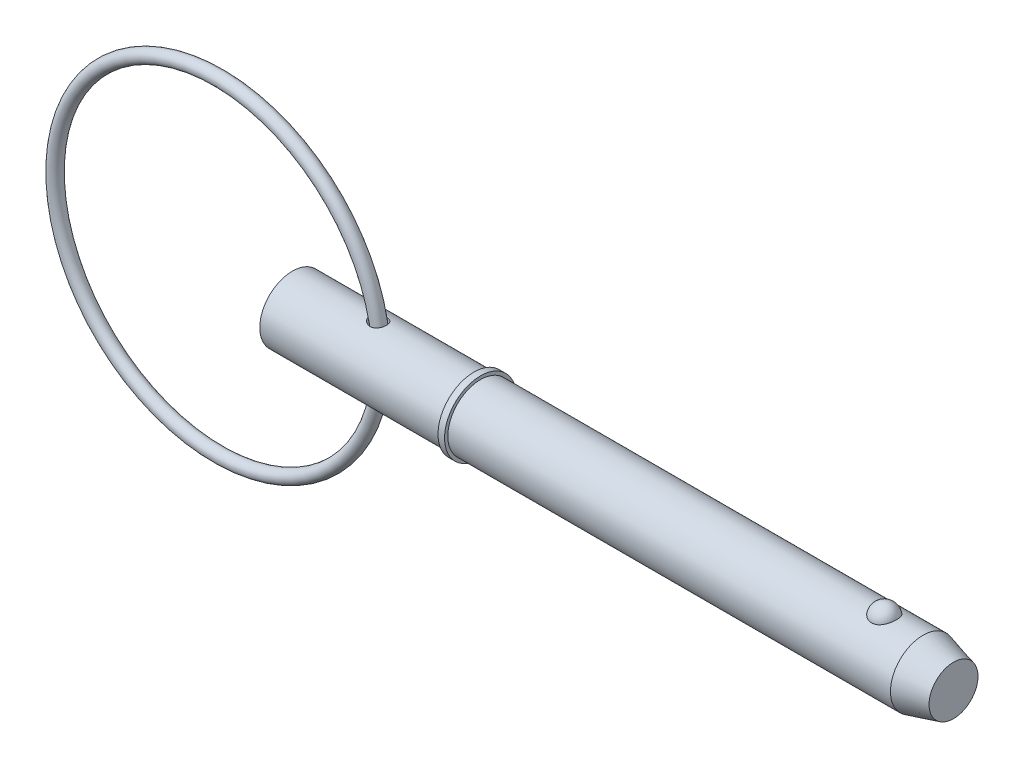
ISO-10303-21;
HEADER;
FILE_DESCRIPTION(('STEP AP214'),'2;1');
FILE_NAME('part.step','',(''),(''),'','','');
FILE_SCHEMA(('AUTOMOTIVE_DESIGN { 1 0 10303 214 1 1 1 1 }'));
ENDSEC;
DATA;
#1=APPLICATION_CONTEXT('core data for automotive mechanical design processes');
#2=APPLICATION_PROTOCOL_DEFINITION('international standard','automotive_design',2000,#1);
#3=PRODUCT_CONTEXT('',#1,'mechanical');
#4=PRODUCT('Part','Part','',(#3));
#5=PRODUCT_RELATED_PRODUCT_CATEGORY('part','',(#4));
#6=PRODUCT_DEFINITION_FORMATION('','',#4);
#7=PRODUCT_DEFINITION_CONTEXT('part definition',#1,'design');
#8=PRODUCT_DEFINITION('design','',#6,#7);
#9=PRODUCT_DEFINITION_SHAPE('','',#8);
#10=(LENGTH_UNIT() NAMED_UNIT(*) SI_UNIT(.MILLI.,.METRE.));
#11=(NAMED_UNIT(*) PLANE_ANGLE_UNIT() SI_UNIT($,.RADIAN.));
#12=(NAMED_UNIT(*) SI_UNIT($,.STERADIAN.) SOLID_ANGLE_UNIT());
#13=UNCERTAINTY_MEASURE_WITH_UNIT(LENGTH_MEASURE(1.E-05),#10,'distance_accuracy_value','');
#14=(GEOMETRIC_REPRESENTATION_CONTEXT(3) GLOBAL_UNCERTAINTY_ASSIGNED_CONTEXT((#13)) GLOBAL_UNIT_ASSIGNED_CONTEXT((#10,
#11,#12)) REPRESENTATION_CONTEXT('',''));
#15=CARTESIAN_POINT('',(0.,0.,0.));
#16=DIRECTION('',(0.,0.,1.));
#17=DIRECTION('',(1.,0.,0.));
#18=AXIS2_PLACEMENT_3D('',#15,#16,#17);
#19=CARTESIAN_POINT('',(-7.21857545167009,0.,0.));
#20=DIRECTION('',(0.,0.,1.));
#21=DIRECTION('',(1.,0.,0.));
#22=AXIS2_PLACEMENT_3D('',#19,#20,#21);
#23=TOROIDAL_SURFACE('',#22,15.875,0.634999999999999);
#24=CARTESIAN_POINT('',(9.29142454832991,0.,0.));
#25=VERTEX_POINT('',#24);
#26=VERTEX_LOOP('',#25);
#27=FACE_BOUND('',#26,.T.);
#28=ADVANCED_FACE('P0_F12',(#27),#23,.T.);
#29=CLOSED_SHELL('',(#28));
#30=MANIFOLD_SOLID_BREP('P0_B1',#29);
#31=CARTESIAN_POINT('',(0.,0.,0.));
#32=DIRECTION('',(1.,0.,0.));
#33=DIRECTION('',(0.,0.,-1.));
#34=AXIS2_PLACEMENT_3D('',#31,#32,#33);
#35=CYLINDRICAL_SURFACE('',#34,3.175);
#36=CARTESIAN_POINT('',(7.68750254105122,3.14043953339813,-0.467187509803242));
#37=CARTESIAN_POINT('',(7.71663570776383,3.13485007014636,-0.504758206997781));
#38=CARTESIAN_POINT('',(7.74907441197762,3.12895198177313,-0.539757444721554));
#39=CARTESIAN_POINT('',(7.81944011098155,3.11722901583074,-0.603799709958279));
#40=CARTESIAN_POINT('',(7.85737550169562,3.11140426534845,-0.632833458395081));
#41=CARTESIAN_POINT('',(7.93756775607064,3.10051072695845,-0.684213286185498));
#42=CARTESIAN_POINT('',(7.97981919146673,3.09544100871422,-0.706567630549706));
#43=CARTESIAN_POINT('',(8.06754397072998,3.08665483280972,-0.744015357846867));
#44=CARTESIAN_POINT('',(8.11301598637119,3.08293782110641,-0.759111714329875));
#45=CARTESIAN_POINT('',(8.20614871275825,3.07732974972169,-0.781538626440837));
#46=CARTESIAN_POINT('',(8.25381727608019,3.07544587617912,-0.788838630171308));
#47=CARTESIAN_POINT('',(8.34973955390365,3.07382984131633,-0.795114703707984));
#48=CARTESIAN_POINT('',(8.39799308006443,3.07409700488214,-0.794093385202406));
#49=CARTESIAN_POINT('',(8.4909727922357,3.07673252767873,-0.783815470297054));
#50=CARTESIAN_POINT('',(8.53575064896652,3.07898913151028,-0.774996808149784));
#51=CARTESIAN_POINT('',(8.62301664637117,3.08521060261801,-0.749844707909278));
#52=CARTESIAN_POINT('',(8.66550527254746,3.08917510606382,-0.733512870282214));
#53=CARTESIAN_POINT('',(8.74528857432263,3.09816330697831,-0.694543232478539));
#54=CARTESIAN_POINT('',(8.78272109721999,3.10313973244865,-0.672175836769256));
#55=CARTESIAN_POINT('',(8.85323831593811,3.11368155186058,-0.621513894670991));
#56=CARTESIAN_POINT('',(8.88632295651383,3.1192469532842,-0.59321927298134));
#57=CARTESIAN_POINT('',(8.94738786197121,3.13037258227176,-0.531394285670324));
#58=CARTESIAN_POINT('',(8.97535151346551,3.13593273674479,-0.497847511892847));
#59=CARTESIAN_POINT('',(9.02535984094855,3.14642822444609,-0.426512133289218));
#60=CARTESIAN_POINT('',(9.04740412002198,3.1513635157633,-0.388723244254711));
#61=CARTESIAN_POINT('',(9.08531615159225,3.16014674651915,-0.309373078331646));
#62=CARTESIAN_POINT('',(9.10109111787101,3.16397813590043,-0.267765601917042));
#63=CARTESIAN_POINT('',(9.12562372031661,3.17004373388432,-0.182419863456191));
#64=CARTESIAN_POINT('',(9.13438129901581,3.17227792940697,-0.138681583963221));
#65=CARTESIAN_POINT('',(9.14467797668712,3.17491257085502,-0.0501907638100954));
#66=CARTESIAN_POINT('',(9.14619790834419,3.17530814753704,-0.00543584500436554));
#67=CARTESIAN_POINT('',(9.14192925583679,3.17420952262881,0.0837005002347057));
#68=CARTESIAN_POINT('',(9.13614065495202,3.17271531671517,0.128081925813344));
#69=CARTESIAN_POINT('',(9.11741184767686,3.16800183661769,0.215146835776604));
#70=CARTESIAN_POINT('',(9.1044818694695,3.1647850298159,0.257832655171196));
#71=CARTESIAN_POINT('',(9.07179341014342,3.15697516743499,0.340371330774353));
#72=CARTESIAN_POINT('',(9.05203467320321,3.15238206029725,0.380224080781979));
#73=CARTESIAN_POINT('',(9.00612949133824,3.14231078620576,0.456042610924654));
#74=CARTESIAN_POINT('',(8.97997137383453,3.13683100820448,0.492001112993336));
#75=CARTESIAN_POINT('',(8.92194141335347,3.12560179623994,0.558920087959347));
#76=CARTESIAN_POINT('',(8.89006980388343,3.11985237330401,0.589880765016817));
#77=CARTESIAN_POINT('',(8.82164045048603,3.10876807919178,0.645751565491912));
#78=CARTESIAN_POINT('',(8.78510991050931,3.1034310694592,0.670694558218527));
#79=CARTESIAN_POINT('',(8.70823767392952,3.09374754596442,0.714035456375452));
#80=CARTESIAN_POINT('',(8.66789657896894,3.08940087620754,0.732434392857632));
#81=CARTESIAN_POINT('',(8.58520620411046,3.08224677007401,0.761976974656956));
#82=CARTESIAN_POINT('',(8.54289637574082,3.07941711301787,0.773225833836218));
#83=CARTESIAN_POINT('',(8.45693772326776,3.07549224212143,0.788693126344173));
#84=CARTESIAN_POINT('',(8.41328889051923,3.07439703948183,0.792911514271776));
#85=CARTESIAN_POINT('',(8.32565716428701,3.07402154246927,0.79436569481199));
#86=CARTESIAN_POINT('',(8.2816736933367,3.07475037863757,0.791566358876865));
#87=CARTESIAN_POINT('',(8.19474198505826,3.0779150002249,0.779168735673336));
#88=CARTESIAN_POINT('',(8.15179398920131,3.0803511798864,0.769568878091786));
#89=CARTESIAN_POINT('',(8.06605600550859,3.08678050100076,0.743371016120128));
#90=CARTESIAN_POINT('',(8.02336243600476,3.09083954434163,0.726473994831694));
#91=CARTESIAN_POINT('',(7.94127890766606,3.10003371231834,0.686178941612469));
#92=CARTESIAN_POINT('',(7.90189016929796,3.10516923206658,0.662778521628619));
#93=CARTESIAN_POINT('',(7.82556689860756,3.11622820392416,0.608722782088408));
#94=CARTESIAN_POINT('',(7.78884764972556,3.12217795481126,0.577767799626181));
#95=CARTESIAN_POINT('',(7.7212485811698,3.13396160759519,0.509990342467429));
#96=CARTESIAN_POINT('',(7.69036894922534,3.13979550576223,0.473167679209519));
#97=CARTESIAN_POINT('',(7.63604128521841,3.15055792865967,0.395137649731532));
#98=CARTESIAN_POINT('',(7.61248286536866,3.15549937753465,0.354009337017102));
#99=CARTESIAN_POINT('',(7.57323986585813,3.16396081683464,0.268021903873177));
#100=CARTESIAN_POINT('',(7.55754910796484,3.16748192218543,0.223165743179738));
#101=CARTESIAN_POINT('',(7.53586686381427,3.17240393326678,0.135111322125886));
#102=CARTESIAN_POINT('',(7.52916366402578,3.17395975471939,0.0920967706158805));
#103=CARTESIAN_POINT('',(7.52342449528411,3.1752897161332,0.00553088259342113));
#104=CARTESIAN_POINT('',(7.52438648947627,3.17506432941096,-0.0380203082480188));
#105=CARTESIAN_POINT('',(7.53361123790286,3.17293298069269,-0.121469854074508));
#106=CARTESIAN_POINT('',(7.54140526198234,3.17113493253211,-0.161424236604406));
#107=CARTESIAN_POINT('',(7.56329403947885,3.16619862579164,-0.239454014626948));
#108=CARTESIAN_POINT('',(7.57738500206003,3.16306117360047,-0.277530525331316));
#109=CARTESIAN_POINT('',(7.60689714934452,3.15670852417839,-0.341419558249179));
#110=CARTESIAN_POINT('',(7.62103486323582,3.15372268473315,-0.367859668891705));
#111=CARTESIAN_POINT('',(7.65218035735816,3.14734507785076,-0.418934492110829));
#112=CARTESIAN_POINT('',(7.66918829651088,3.14395328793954,-0.443569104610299));
#113=CARTESIAN_POINT('',(7.68750254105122,3.14043953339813,-0.467187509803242));
#114=B_SPLINE_CURVE_WITH_KNOTS('',3,(#36,#37,#38,#39,#40,#41,#42,#43,#44,#45,#46,#47,#48,#49,
#50,#51,#52,#53,#54,#55,#56,#57,#58,#59,#60,#61,#62,#63,#64,#65,#66,#67,#68,#69,#70,#71,#72,#73,
#74,#75,#76,#77,#78,#79,#80,#81,#82,#83,#84,#85,#86,#87,#88,#89,#90,#91,#92,#93,#94,#95,#96,#97,
#98,#99,#100,#101,#102,#103,#104,#105,#106,#107,#108,#109,#110,#111,#112,#113),.UNSPECIFIED.,
.T.,.F.,(4,2,2,2,2,2,2,2,2,2,2,2,2,2,2,2,2,2,2,2,2,2,2,2,2,2,2,2,2,2,2,2,2,2,2,2,2,2,4),(0.,
0.143496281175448,0.287214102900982,0.430753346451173,0.574233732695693,0.71827434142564,
0.862269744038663,0.998657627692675,1.13501647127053,1.26606395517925,1.39711310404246,
1.52858014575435,1.66005600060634,1.79341107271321,1.92676723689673,2.06047636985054,
2.19418580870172,2.32770423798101,2.46122766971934,2.59499649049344,2.72875984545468,
2.86177513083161,2.99476944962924,3.12575845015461,3.25674829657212,3.38839514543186,
3.5200724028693,3.65775119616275,3.79548061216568,3.93996868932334,4.08446141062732,
4.22665598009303,4.36873871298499,4.49873145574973,4.62868965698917,4.7503735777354,
4.87198434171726,4.96218670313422,5.05239406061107),.UNSPECIFIED.);
#115=CARTESIAN_POINT('',(7.68750254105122,3.14043953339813,-0.467187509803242));
#116=VERTEX_POINT('',#115);
#117=EDGE_CURVE('P1_E42',#116,#116,#114,.T.);
#118=ORIENTED_EDGE('',*,*,#117,.T.);
#119=EDGE_LOOP('',(#118));
#120=FACE_BOUND('',#119,.T.);
#121=CARTESIAN_POINT('',(0.,0.,0.));
#122=DIRECTION('',(1.,0.,0.));
#123=DIRECTION('',(0.,0.,-1.));
#124=AXIS2_PLACEMENT_3D('',#121,#122,#123);
#125=CIRCLE('',#124,3.175);
#126=CARTESIAN_POINT('',(0.,0.,-3.175));
#127=VERTEX_POINT('',#126);
#128=EDGE_CURVE('P1_E9',#127,#127,#125,.T.);
#129=ORIENTED_EDGE('',*,*,#128,.T.);
#130=EDGE_LOOP('',(#129));
#131=FACE_BOUND('',#130,.T.);
#132=CARTESIAN_POINT('',(17.655,0.,0.));
#133=DIRECTION('',(1.,0.,0.));
#134=DIRECTION('',(0.,0.,-1.));
#135=AXIS2_PLACEMENT_3D('',#132,#133,#134);
#136=CIRCLE('',#135,3.175);
#137=CARTESIAN_POINT('',(17.655,0.,-3.175));
#138=VERTEX_POINT('',#137);
#139=EDGE_CURVE('P1_E25',#138,#138,#136,.T.);
#140=ORIENTED_EDGE('',*,*,#139,.F.);
#141=EDGE_LOOP('',(#140));
#142=FACE_BOUND('',#141,.T.);
#143=CARTESIAN_POINT('',(7.68750254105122,-3.14043953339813,-0.467187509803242));
#144=CARTESIAN_POINT('',(7.66134108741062,-3.14545876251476,-0.433446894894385));
#145=CARTESIAN_POINT('',(7.63782862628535,-3.15023199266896,-0.397612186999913));
#146=CARTESIAN_POINT('',(7.59691922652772,-3.15880505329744,-0.322493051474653));
#147=CARTESIAN_POINT('',(7.57952031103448,-3.16260519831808,-0.283209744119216));
#148=CARTESIAN_POINT('',(7.55152687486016,-3.16882833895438,-0.202021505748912));
#149=CARTESIAN_POINT('',(7.54095517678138,-3.17124671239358,-0.160108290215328));
#150=CARTESIAN_POINT('',(7.52724513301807,-3.1743985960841,-0.0750206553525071));
#151=CARTESIAN_POINT('',(7.52410469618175,-3.17513258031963,-0.031846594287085));
#152=CARTESIAN_POINT('',(7.5253875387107,-3.17483506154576,0.0522260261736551));
#153=CARTESIAN_POINT('',(7.52944265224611,-3.17388949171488,0.0931310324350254));
#154=CARTESIAN_POINT('',(7.54421042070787,-3.17050389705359,0.1736507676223));
#155=CARTESIAN_POINT('',(7.5549232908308,-3.16806382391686,0.213265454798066));
#156=CARTESIAN_POINT('',(7.58252065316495,-3.16195002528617,0.290147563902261));
#157=CARTESIAN_POINT('',(7.59940259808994,-3.15827680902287,0.32741594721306));
#158=CARTESIAN_POINT('',(7.63869293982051,-3.15005936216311,0.398803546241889));
#159=CARTESIAN_POINT('',(7.66110286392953,-3.14551489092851,0.432921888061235));
#160=CARTESIAN_POINT('',(7.71258278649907,-3.13561737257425,0.49975352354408));
#161=CARTESIAN_POINT('',(7.74202268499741,-3.13022938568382,0.532176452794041));
#162=CARTESIAN_POINT('',(7.80559890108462,-3.11946135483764,0.592041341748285));
#163=CARTESIAN_POINT('',(7.83973728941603,-3.11408131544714,0.619481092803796));
#164=CARTESIAN_POINT('',(7.91474520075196,-3.10344314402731,0.670826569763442));
#165=CARTESIAN_POINT('',(7.95593439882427,-3.09822894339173,0.694276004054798));
#166=CARTESIAN_POINT('',(8.04171965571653,-3.08902387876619,0.734150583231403));
#167=CARTESIAN_POINT('',(8.08631621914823,-3.08503319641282,0.750574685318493));
#168=CARTESIAN_POINT('',(8.17840269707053,-3.07873340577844,0.776016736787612));
#169=CARTESIAN_POINT('',(8.22592511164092,-3.07644943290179,0.784924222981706));
#170=CARTESIAN_POINT('',(8.3218479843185,-3.07400734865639,0.79443684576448));
#171=CARTESIAN_POINT('',(8.37024809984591,-3.07384842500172,0.79504515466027));
#172=CARTESIAN_POINT('',(8.46394967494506,-3.07568838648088,0.787894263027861));
#173=CARTESIAN_POINT('',(8.50928504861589,-3.07757975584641,0.78055200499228));
#174=CARTESIAN_POINT('',(8.5979121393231,-3.0831587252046,0.758214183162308));
#175=CARTESIAN_POINT('',(8.6412043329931,-3.08684590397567,0.743220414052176));
#176=CARTESIAN_POINT('',(8.72259527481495,-3.09539071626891,0.706762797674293));
#177=CARTESIAN_POINT('',(8.7608371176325,-3.10019138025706,0.685603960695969));
#178=CARTESIAN_POINT('',(8.83314563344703,-3.11049979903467,0.637201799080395));
#179=CARTESIAN_POINT('',(8.86721230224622,-3.11600755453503,0.609958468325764));
#180=CARTESIAN_POINT('',(8.93027727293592,-3.12712026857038,0.550151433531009));
#181=CARTESIAN_POINT('',(8.95927559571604,-3.13272522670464,0.517587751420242));
#182=CARTESIAN_POINT('',(9.01149093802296,-3.14342495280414,0.448041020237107));
#183=CARTESIAN_POINT('',(9.03470756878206,-3.14851968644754,0.411057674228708));
#184=CARTESIAN_POINT('',(9.07510046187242,-3.15772445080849,0.333109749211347));
#185=CARTESIAN_POINT('',(9.09218248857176,-3.16181883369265,0.292094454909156));
#186=CARTESIAN_POINT('',(9.11940464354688,-3.16848144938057,0.207703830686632));
#187=CARTESIAN_POINT('',(9.12954467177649,-3.17104966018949,0.164328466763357));
#188=CARTESIAN_POINT('',(9.14265964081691,-3.17439058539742,0.0762710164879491));
#189=CARTESIAN_POINT('',(9.14560734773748,-3.17515647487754,0.0315846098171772));
#190=CARTESIAN_POINT('',(9.14418482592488,-3.1747899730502,-0.0576634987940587));
#191=CARTESIAN_POINT('',(9.13981460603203,-3.17365758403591,-0.102225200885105));
#192=CARTESIAN_POINT('',(9.12387791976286,-3.1696201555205,-0.189883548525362));
#193=CARTESIAN_POINT('',(9.11232323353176,-3.16671801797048,-0.232982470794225));
#194=CARTESIAN_POINT('',(9.08231097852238,-3.15945654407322,-0.316576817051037));
#195=CARTESIAN_POINT('',(9.06385315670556,-3.15509715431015,-0.357072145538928));
#196=CARTESIAN_POINT('',(9.02044668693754,-3.14538636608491,-0.434386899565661));
#197=CARTESIAN_POINT('',(8.99548654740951,-3.14003321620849,-0.471199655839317));
#198=CARTESIAN_POINT('',(8.93971208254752,-3.12893289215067,-0.540019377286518));
#199=CARTESIAN_POINT('',(8.9088979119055,-3.12318572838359,-0.572026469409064));
#200=CARTESIAN_POINT('',(8.84235816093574,-3.11197156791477,-0.630185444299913));
#201=CARTESIAN_POINT('',(8.80665432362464,-3.10650347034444,-0.656361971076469));
#202=CARTESIAN_POINT('',(8.73121463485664,-3.09644726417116,-0.702277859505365));
#203=CARTESIAN_POINT('',(8.69147940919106,-3.0918590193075,-0.722018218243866));
#204=CARTESIAN_POINT('',(8.60974645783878,-3.08414607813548,-0.754281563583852));
#205=CARTESIAN_POINT('',(8.56779175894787,-3.08100040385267,-0.766908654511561));
#206=CARTESIAN_POINT('',(8.48229847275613,-3.07640651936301,-0.785135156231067));
#207=CARTESIAN_POINT('',(8.4387599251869,-3.07495826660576,-0.790734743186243));
#208=CARTESIAN_POINT('',(8.35126980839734,-3.07388240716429,-0.794906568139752));
#209=CARTESIAN_POINT('',(8.30731772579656,-3.07425748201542,-0.79346845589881));
#210=CARTESIAN_POINT('',(8.22022709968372,-3.07674606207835,-0.783761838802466));
#211=CARTESIAN_POINT('',(8.17708875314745,-3.07885998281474,-0.775491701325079));
#212=CARTESIAN_POINT('',(8.09089465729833,-3.08468414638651,-0.751997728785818));
#213=CARTESIAN_POINT('',(8.0479194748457,-3.08845808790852,-0.736494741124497));
#214=CARTESIAN_POINT('',(7.96504527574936,-3.09716853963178,-0.698957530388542));
#215=CARTESIAN_POINT('',(7.92514708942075,-3.10210536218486,-0.676921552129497));
#216=CARTESIAN_POINT('',(7.8492503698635,-3.11263013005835,-0.626751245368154));
#217=CARTESIAN_POINT('',(7.81326800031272,-3.11822059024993,-0.598592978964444));
#218=CARTESIAN_POINT('',(7.74635335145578,-3.12944726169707,-0.53681285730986));
#219=CARTESIAN_POINT('',(7.71541970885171,-3.13508346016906,-0.503192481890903));
#220=CARTESIAN_POINT('',(7.68750254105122,-3.14043953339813,-0.467187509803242));
#221=B_SPLINE_CURVE_WITH_KNOTS('',3,(#143,#144,#145,#146,#147,#148,#149,#150,#151,#152,#153,
#154,#155,#156,#157,#158,#159,#160,#161,#162,#163,#164,#165,#166,#167,#168,#169,#170,#171,#172,
#173,#174,#175,#176,#177,#178,#179,#180,#181,#182,#183,#184,#185,#186,#187,#188,#189,#190,#191,
#192,#193,#194,#195,#196,#197,#198,#199,#200,#201,#202,#203,#204,#205,#206,#207,#208,#209,#210,
#211,#212,#213,#214,#215,#216,#217,#218,#219,#220),.UNSPECIFIED.,.T.,.F.,(4,2,2,2,2,2,2,2,2,2,2,
2,2,2,2,2,2,2,2,2,2,2,2,2,2,2,2,2,2,2,2,2,2,2,2,2,2,2,4),(0.,0.128825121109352,
0.257608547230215,0.386820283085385,0.515995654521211,0.638750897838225,0.761510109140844,
0.884218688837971,1.00696120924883,1.13877828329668,1.27065363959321,1.41304496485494,
1.55545741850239,1.69992800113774,1.84434335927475,1.98153642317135,2.11869732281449,
2.24997668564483,2.38125618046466,2.51253513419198,2.64382291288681,2.77704892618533,
2.91027685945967,3.04400848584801,3.17773995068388,3.31125271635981,3.44477037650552,
3.5785256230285,3.71227733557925,3.84545251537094,3.97860705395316,4.10975853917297,
4.24090673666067,4.37224786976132,4.50362039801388,4.64054596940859,4.77750836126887,
4.91501622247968,5.05248689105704),.UNSPECIFIED.);
#222=CARTESIAN_POINT('',(7.68750254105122,-3.14043953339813,-0.467187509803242));
#223=VERTEX_POINT('',#222);
#224=EDGE_CURVE('P1_E17',#223,#223,#221,.T.);
#225=ORIENTED_EDGE('',*,*,#224,.T.);
#226=EDGE_LOOP('',(#225));
#227=FACE_BOUND('',#226,.T.);
#228=ADVANCED_FACE('P1_F13',(#120,#131,#142,#227),#35,.T.);
#229=CARTESIAN_POINT('',(0.,0.,0.));
#230=DIRECTION('',(1.,0.,0.));
#231=DIRECTION('',(0.,0.,-1.));
#232=AXIS2_PLACEMENT_3D('',#229,#230,#231);
#233=CYLINDRICAL_SURFACE('',#232,3.175);
#234=CARTESIAN_POINT('',(61.3476846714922,0.,0.));
#235=DIRECTION('',(1.,0.,0.));
#236=DIRECTION('',(0.,0.,-1.));
#237=AXIS2_PLACEMENT_3D('',#234,#235,#236);
#238=CIRCLE('',#237,3.175);
#239=CARTESIAN_POINT('',(61.3476846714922,0.,-3.175));
#240=VERTEX_POINT('',#239);
#241=EDGE_CURVE('P1_E99',#240,#240,#238,.T.);
#242=ORIENTED_EDGE('',*,*,#241,.F.);
#243=EDGE_LOOP('',(#242));
#244=FACE_BOUND('',#243,.T.);
#245=CARTESIAN_POINT('',(18.29,0.,0.));
#246=DIRECTION('',(1.,0.,0.));
#247=DIRECTION('',(0.,0.,-1.));
#248=AXIS2_PLACEMENT_3D('',#245,#246,#247);
#249=CIRCLE('',#248,3.175);
#250=CARTESIAN_POINT('',(18.29,0.,-3.175));
#251=VERTEX_POINT('',#250);
#252=EDGE_CURVE('P1_E96',#251,#251,#249,.T.);
#253=ORIENTED_EDGE('',*,*,#252,.T.);
#254=EDGE_LOOP('',(#253));
#255=FACE_BOUND('',#254,.T.);
#256=CARTESIAN_POINT('',(57.5757276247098,2.92898950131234,1.2254164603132));
#257=CARTESIAN_POINT('',(57.512316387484,2.92899434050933,1.22541146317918));
#258=CARTESIAN_POINT('',(57.4487979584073,2.93112688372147,1.22034641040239));
#259=CARTESIAN_POINT('',(57.3235306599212,2.93942752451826,1.2002094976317));
#260=CARTESIAN_POINT('',(57.2617869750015,2.9456063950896,1.1851109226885));
#261=CARTESIAN_POINT('',(57.1420651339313,2.96127115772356,1.14540352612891));
#262=CARTESIAN_POINT('',(57.0840775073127,2.97074831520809,1.12081980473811));
#263=CARTESIAN_POINT('',(56.9731943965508,2.99197584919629,1.06285154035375));
#264=CARTESIAN_POINT('',(56.9202966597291,3.0037252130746,1.02947091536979));
#265=CARTESIAN_POINT('',(56.8192688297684,3.02865714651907,0.953674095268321));
#266=CARTESIAN_POINT('',(56.771324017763,3.04187163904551,0.911021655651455));
#267=CARTESIAN_POINT('',(56.6830360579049,3.06808741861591,0.818400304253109));
#268=CARTESIAN_POINT('',(56.6426952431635,3.08108863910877,0.768429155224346));
#269=CARTESIAN_POINT('',(56.5688039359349,3.10614903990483,0.660064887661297));
#270=CARTESIAN_POINT('',(56.5356330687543,3.11814104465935,0.601396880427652));
#271=CARTESIAN_POINT('',(56.4791190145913,3.13926931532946,0.479026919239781));
#272=CARTESIAN_POINT('',(56.4557764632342,3.14840539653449,0.415324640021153));
#273=CARTESIAN_POINT('',(56.4191785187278,3.16298160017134,0.283885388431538));
#274=CARTESIAN_POINT('',(56.4060407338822,3.16837855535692,0.21611080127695));
#275=CARTESIAN_POINT('',(56.3905676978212,3.17475386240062,0.079136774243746));
#276=CARTESIAN_POINT('',(56.388232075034,3.17573236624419,0.00993738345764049));
#277=CARTESIAN_POINT('',(56.3943886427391,3.17318075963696,-0.127420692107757));
#278=CARTESIAN_POINT('',(56.4028073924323,3.16968122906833,-0.195583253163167));
#279=CARTESIAN_POINT('',(56.4301752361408,3.1585790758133,-0.329413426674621));
#280=CARTESIAN_POINT('',(56.4491245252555,3.15097637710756,-0.395080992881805));
#281=CARTESIAN_POINT('',(56.4972057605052,3.13242485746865,-0.522180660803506));
#282=CARTESIAN_POINT('',(56.5263524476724,3.12147119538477,-0.583606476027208));
#283=CARTESIAN_POINT('',(56.5942352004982,3.09734973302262,-0.700436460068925));
#284=CARTESIAN_POINT('',(56.632972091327,3.08418174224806,-0.7558401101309));
#285=CARTESIAN_POINT('',(56.7194771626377,3.05694884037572,-0.859404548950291));
#286=CARTESIAN_POINT('',(56.7672961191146,3.04287919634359,-0.907521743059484));
#287=CARTESIAN_POINT('',(56.8707353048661,3.01548927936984,-0.994758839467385));
#288=CARTESIAN_POINT('',(56.9263549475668,3.0021689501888,-1.03387941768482));
#289=CARTESIAN_POINT('',(57.0428093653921,2.97810316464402,-1.10126594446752));
#290=CARTESIAN_POINT('',(57.1035182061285,2.96731170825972,-1.12973256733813));
#291=CARTESIAN_POINT('',(57.2293712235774,2.94928934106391,-1.17598467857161));
#292=CARTESIAN_POINT('',(57.2945137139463,2.94205708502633,-1.19377420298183));
#293=CARTESIAN_POINT('',(57.4238562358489,2.93233065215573,-1.21746387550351));
#294=CARTESIAN_POINT('',(57.4879385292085,2.92961621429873,-1.22391763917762));
#295=CARTESIAN_POINT('',(57.6163375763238,2.92855752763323,-1.22644976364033));
#296=CARTESIAN_POINT('',(57.6806542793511,2.93021238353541,-1.22253024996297));
#297=CARTESIAN_POINT('',(57.8055239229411,2.9375685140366,-1.20474140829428));
#298=CARTESIAN_POINT('',(57.866131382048,2.94313790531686,-1.19119621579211));
#299=CARTESIAN_POINT('',(57.9841106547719,2.95756226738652,-1.15491492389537));
#300=CARTESIAN_POINT('',(58.0414822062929,2.96641750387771,-1.13217808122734));
#301=CARTESIAN_POINT('',(58.1527699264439,2.98669918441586,-1.07755083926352));
#302=CARTESIAN_POINT('',(58.2065845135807,2.9981771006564,-1.04547308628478));
#303=CARTESIAN_POINT('',(58.3081473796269,3.02240235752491,-0.973220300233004));
#304=CARTESIAN_POINT('',(58.3558942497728,3.03514999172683,-0.933043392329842));
#305=CARTESIAN_POINT('',(58.4465817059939,3.06131230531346,-0.843372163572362));
#306=CARTESIAN_POINT('',(58.4891588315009,3.07472822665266,-0.793510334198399));
#307=CARTESIAN_POINT('',(58.5656765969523,3.10021106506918,-0.687241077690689));
#308=CARTESIAN_POINT('',(58.5996156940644,3.1122777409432,-0.630832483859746));
#309=CARTESIAN_POINT('',(58.6591209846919,3.134208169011,-0.511059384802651));
#310=CARTESIAN_POINT('',(58.6843892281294,3.14399040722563,-0.447531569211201));
#311=CARTESIAN_POINT('',(58.7245117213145,3.15983820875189,-0.316827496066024));
#312=CARTESIAN_POINT('',(58.7393659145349,3.16590375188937,-0.249651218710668));
#313=CARTESIAN_POINT('',(58.758358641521,3.17370076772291,-0.113549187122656));
#314=CARTESIAN_POINT('',(58.7624966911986,3.17543204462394,-0.0446233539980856));
#315=CARTESIAN_POINT('',(58.7599697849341,3.17438372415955,0.0929938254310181));
#316=CARTESIAN_POINT('',(58.7533050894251,3.17160423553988,0.161685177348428));
#317=CARTESIAN_POINT('',(58.7293754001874,3.1618438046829,0.296502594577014));
#318=CARTESIAN_POINT('',(58.7121674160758,3.15488546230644,0.36264043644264));
#319=CARTESIAN_POINT('',(58.667547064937,3.13748892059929,0.490896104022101));
#320=CARTESIAN_POINT('',(58.6401339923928,3.12705048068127,0.553013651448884));
#321=CARTESIAN_POINT('',(58.5754626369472,3.10369139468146,0.671876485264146));
#322=CARTESIAN_POINT('',(58.5381467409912,3.0907563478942,0.728587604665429));
#323=CARTESIAN_POINT('',(58.4545246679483,3.06381731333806,0.834653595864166));
#324=CARTESIAN_POINT('',(58.4082189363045,3.04981337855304,0.884008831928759));
#325=CARTESIAN_POINT('',(58.3077184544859,3.02230423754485,0.973916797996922));
#326=CARTESIAN_POINT('',(58.253535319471,3.00879833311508,1.01448227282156));
#327=CARTESIAN_POINT('',(58.1385299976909,2.98383625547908,1.0857155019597));
#328=CARTESIAN_POINT('',(58.0777053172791,2.9723808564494,1.11637952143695));
#329=CARTESIAN_POINT('',(57.9533690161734,2.95329063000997,1.16592590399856));
#330=CARTESIAN_POINT('',(57.8900230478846,2.9455373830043,1.18517901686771));
#331=CARTESIAN_POINT('',(57.7607664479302,2.9342556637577,1.21284802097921));
#332=CARTESIAN_POINT('',(57.6948641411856,2.93071450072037,1.22129647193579));
#333=CARTESIAN_POINT('',(57.611116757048,2.9291525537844,1.22502505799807));
#334=CARTESIAN_POINT('',(57.5934263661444,2.9289881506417,1.22541785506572));
#335=CARTESIAN_POINT('',(57.5757276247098,2.92898950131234,1.2254164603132));
#336=B_SPLINE_CURVE_WITH_KNOTS('',3,(#256,#257,#258,#259,#260,#261,#262,#263,#264,#265,#266,
#267,#268,#269,#270,#271,#272,#273,#274,#275,#276,#277,#278,#279,#280,#281,#282,#283,#284,#285,
#286,#287,#288,#289,#290,#291,#292,#293,#294,#295,#296,#297,#298,#299,#300,#301,#302,#303,#304,
#305,#306,#307,#308,#309,#310,#311,#312,#313,#314,#315,#316,#317,#318,#319,#320,#321,#322,#323,
#324,#325,#326,#327,#328,#329,#330,#331,#332,#333,#334,#335),.UNSPECIFIED.,.T.,.F.,(4,2,2,2,2,2,
2,2,2,2,2,2,2,2,2,2,2,2,2,2,2,2,2,2,2,2,2,2,2,2,2,2,2,2,2,2,2,2,2,4),(0.,0.190186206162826,
0.380880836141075,0.571074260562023,0.761183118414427,0.95686644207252,1.1526097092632,
1.35701770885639,1.56143892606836,1.76818248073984,1.97491892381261,2.18025109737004,
2.38558707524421,2.59122111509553,2.79687285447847,3.0037101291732,3.21053185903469,
3.41323429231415,3.61586005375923,3.80828192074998,4.00066436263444,4.18685798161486,
4.37306665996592,4.56330302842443,4.75358348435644,4.95345287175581,5.15335793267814,
5.35957003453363,5.56578325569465,5.77200579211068,5.97822335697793,6.18333558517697,
6.38846199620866,6.59480900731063,6.80114579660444,7.00718137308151,7.21329457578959,
7.41228022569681,7.61066481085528,7.66374777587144),.UNSPECIFIED.);
#337=CARTESIAN_POINT('',(57.5757276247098,2.92898950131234,1.2254164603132));
#338=VERTEX_POINT('',#337);
#339=EDGE_CURVE('P1_E34',#338,#338,#336,.T.);
#340=ORIENTED_EDGE('',*,*,#339,.T.);
#341=EDGE_LOOP('',(#340));
#342=FACE_BOUND('',#341,.T.);
#343=ADVANCED_FACE('P1_F46',(#244,#255,#342),#233,.T.);
#344=CARTESIAN_POINT('',(0.,0.,0.));
#345=DIRECTION('',(-1.,0.,0.));
#346=DIRECTION('',(0.,0.,1.));
#347=AXIS2_PLACEMENT_3D('',#344,#345,#346);
#348=PLANE('',#347);
#349=ORIENTED_EDGE('',*,*,#128,.F.);
#350=EDGE_LOOP('',(#349));
#351=FACE_BOUND('',#350,.T.);
#352=ADVANCED_FACE('P1_F15',(#351),#348,.T.);
#353=CARTESIAN_POINT('',(17.655,3.175,0.));
#354=DIRECTION('',(-1.,0.,0.));
#355=DIRECTION('',(0.,0.,1.));
#356=AXIS2_PLACEMENT_3D('',#353,#354,#355);
#357=PLANE('',#356);
#358=ORIENTED_EDGE('',*,*,#139,.T.);
#359=EDGE_LOOP('',(#358));
#360=FACE_BOUND('',#359,.T.);
#361=CARTESIAN_POINT('',(17.655,0.,0.));
#362=DIRECTION('',(1.,0.,0.));
#363=DIRECTION('',(0.,0.,-1.));
#364=AXIS2_PLACEMENT_3D('',#361,#362,#363);
#365=CIRCLE('',#364,3.4925);
#366=CARTESIAN_POINT('',(17.655,0.,-3.4925));
#367=VERTEX_POINT('',#366);
#368=EDGE_CURVE('P1_E30',#367,#367,#365,.T.);
#369=ORIENTED_EDGE('',*,*,#368,.F.);
#370=EDGE_LOOP('',(#369));
#371=FACE_BOUND('',#370,.T.);
#372=ADVANCED_FACE('P1_F81',(#360,#371),#357,.T.);
#373=CARTESIAN_POINT('',(0.,0.,0.));
#374=DIRECTION('',(1.,0.,0.));
#375=DIRECTION('',(0.,0.,-1.));
#376=AXIS2_PLACEMENT_3D('',#373,#374,#375);
#377=CYLINDRICAL_SURFACE('',#376,3.4925);
#378=ORIENTED_EDGE('',*,*,#368,.T.);
#379=EDGE_LOOP('',(#378));
#380=FACE_BOUND('',#379,.T.);
#381=CARTESIAN_POINT('',(18.29,0.,0.));
#382=DIRECTION('',(1.,0.,0.));
#383=DIRECTION('',(0.,0.,-1.));
#384=AXIS2_PLACEMENT_3D('',#381,#382,#383);
#385=CIRCLE('',#384,3.4925);
#386=CARTESIAN_POINT('',(18.29,0.,-3.4925));
#387=VERTEX_POINT('',#386);
#388=EDGE_CURVE('P1_E95',#387,#387,#385,.T.);
#389=ORIENTED_EDGE('',*,*,#388,.F.);
#390=EDGE_LOOP('',(#389));
#391=FACE_BOUND('',#390,.T.);
#392=ADVANCED_FACE('P1_F68',(#380,#391),#377,.T.);
#393=CARTESIAN_POINT('',(18.29,3.4925,0.));
#394=DIRECTION('',(1.,0.,0.));
#395=DIRECTION('',(0.,0.,-1.));
#396=AXIS2_PLACEMENT_3D('',#393,#394,#395);
#397=PLANE('',#396);
#398=ORIENTED_EDGE('',*,*,#388,.T.);
#399=EDGE_LOOP('',(#398));
#400=FACE_BOUND('',#399,.T.);
#401=ORIENTED_EDGE('',*,*,#252,.F.);
#402=EDGE_LOOP('',(#401));
#403=FACE_BOUND('',#402,.T.);
#404=ADVANCED_FACE('P1_F62',(#400,#403),#397,.T.);
#405=CARTESIAN_POINT('',(64.31,0.,0.));
#406=DIRECTION('',(-1.,0.,0.));
#407=DIRECTION('',(0.,0.,1.));
#408=AXIS2_PLACEMENT_3D('',#405,#406,#407);
#409=CONICAL_SURFACE('',#408,2.38125000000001,0.261799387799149);
#410=ORIENTED_EDGE('',*,*,#241,.T.);
#411=EDGE_LOOP('',(#410));
#412=FACE_BOUND('',#411,.T.);
#413=CARTESIAN_POINT('',(64.31,0.,0.));
#414=DIRECTION('',(1.,0.,0.));
#415=DIRECTION('',(0.,0.,-1.));
#416=AXIS2_PLACEMENT_3D('',#413,#414,#415);
#417=CIRCLE('',#416,2.38125000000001);
#418=CARTESIAN_POINT('',(64.31,0.,-2.38125000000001));
#419=VERTEX_POINT('',#418);
#420=EDGE_CURVE('P1_E41',#419,#419,#417,.T.);
#421=ORIENTED_EDGE('',*,*,#420,.F.);
#422=EDGE_LOOP('',(#421));
#423=FACE_BOUND('',#422,.T.);
#424=ADVANCED_FACE('P1_F59',(#412,#423),#409,.T.);
#425=CARTESIAN_POINT('',(64.31,2.38125000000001,0.));
#426=DIRECTION('',(1.,0.,0.));
#427=DIRECTION('',(0.,0.,-1.));
#428=AXIS2_PLACEMENT_3D('',#425,#426,#427);
#429=PLANE('',#428);
#430=ORIENTED_EDGE('',*,*,#420,.T.);
#431=EDGE_LOOP('',(#430));
#432=FACE_BOUND('',#431,.T.);
#433=ADVANCED_FACE('P1_F55',(#432),#429,.T.);
#434=CARTESIAN_POINT('',(57.5757276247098,2.8575,0.));
#435=DIRECTION('',(-1.,0.,0.));
#436=DIRECTION('',(0.,1.,0.));
#437=AXIS2_PLACEMENT_3D('',#434,#435,#436);
#438=SPHERICAL_SURFACE('',#437,1.2275);
#439=ORIENTED_EDGE('',*,*,#339,.F.);
#440=EDGE_LOOP('',(#439));
#441=FACE_BOUND('',#440,.T.);
#442=ADVANCED_FACE('P1_F50',(#441),#438,.T.);
#443=CARTESIAN_POINT('',(-7.21857545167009,0.,0.));
#444=DIRECTION('',(0.,0.,1.));
#445=DIRECTION('',(1.,0.,0.));
#446=AXIS2_PLACEMENT_3D('',#443,#444,#445);
#447=TOROIDAL_SURFACE('',#446,15.875,0.793749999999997);
#448=ORIENTED_EDGE('',*,*,#224,.F.);
#449=EDGE_LOOP('',(#448));
#450=FACE_BOUND('',#449,.T.);
#451=ORIENTED_EDGE('',*,*,#117,.F.);
#452=EDGE_LOOP('',(#451));
#453=FACE_BOUND('',#452,.T.);
#454=ADVANCED_FACE('P1_F54',(#450,#453),#447,.F.);
#455=CLOSED_SHELL('',(#228,#343,#352,#372,#392,#404,#424,#433,#442,#454));
#456=MANIFOLD_SOLID_BREP('P1_B1',#455);
#457=ADVANCED_BREP_SHAPE_REPRESENTATION('',(#18,#30,#456),#14);
#458=SHAPE_DEFINITION_REPRESENTATION(#9,#457);
ENDSEC;
END-ISO-10303-21;
